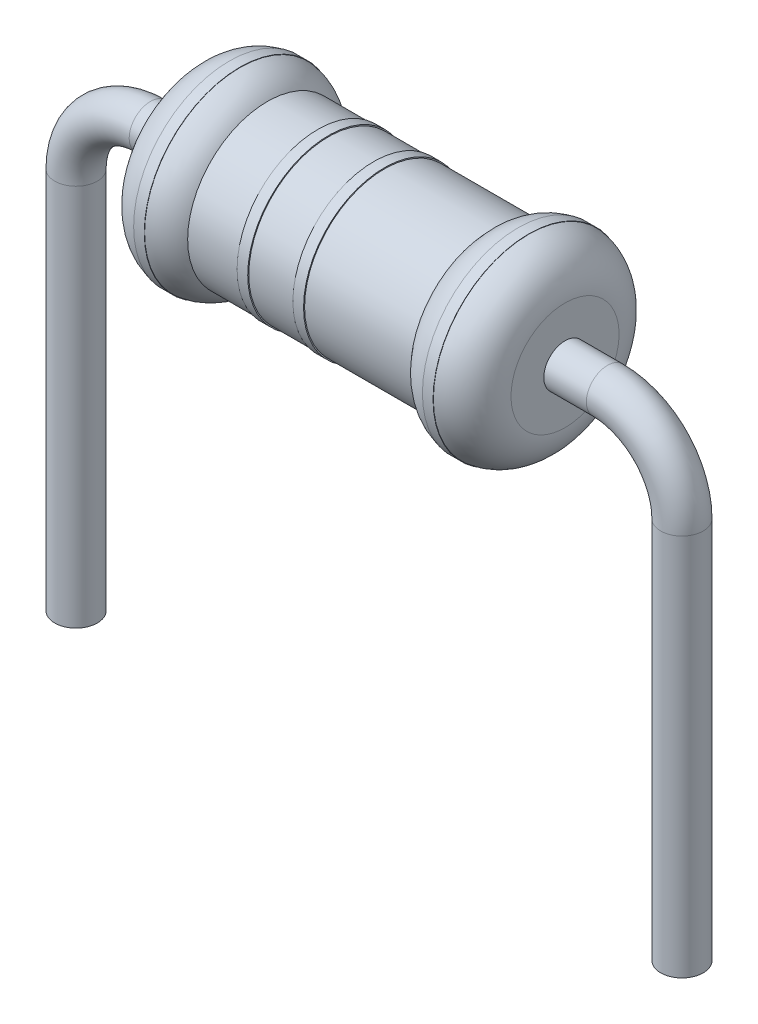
from build123d import *

# Parameters (mm, degrees)
ESQUISSE3_R                  = 0.2
R_P_TITION_CIRCULAIRE1_COUNT = 2


with BuildPart() as part:
    # Esquisse1 → R_volution1 (revolve)
    with BuildSketch(Plane.XY, mode=Mode.PRIVATE) as r_volution1_sk:
        with BuildLine():
            Line((-1.75, 0), (1.75, 0))
            Line((1.75, 0), (1.75, 0.508257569))
            ThreePointArc((1.75, 0.508257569), (1.652408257, 0.766980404), (1.408257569, 0.896796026))
            Line((1.408257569, 0.896796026), (1.408257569, 0.9))
            Line((1.408257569, 0.9), (1.308257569, 0.9))
            Line((1.308257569, 0.9), (1.308257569, 0.896796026))
            ThreePointArc((1.308257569, 0.896796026), (1.164674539, 0.848827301), (1.05, 0.75))
            Line((1.05, 0.75), (0.05, 0.75))
            Line((0.05, 0.75), (0.05, 0.76))
            Line((0.05, 0.76), (-0.05, 0.76))
            Line((-0.05, 0.76), (-0.05, 0.75))
            Line((-0.05, 0.75), (-0.475, 0.75))
            Line((-0.475, 0.75), (-0.475, 0.76))
            Line((-0.475, 0.76), (-0.575, 0.76))
            Line((-0.575, 0.76), (-0.575, 0.75))
            Line((-0.575, 0.75), (-1.05, 0.75))
            ThreePointArc((-1.05, 0.75), (-1.164674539, 0.848827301), (-1.308257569, 0.896796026))
            Line((-1.308257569, 0.896796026), (-1.308257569, 0.9))
            Line((-1.308257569, 0.9), (-1.408257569, 0.9))
            Line((-1.408257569, 0.9), (-1.408257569, 0.896796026))
            ThreePointArc((-1.408257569, 0.896796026), (-1.652408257, 0.766980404), (-1.75, 0.508257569))
            Line((-1.75, 0.508257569), (-1.75, 0))
        make_face()
    revolve(r_volution1_sk.sketch.rotate(Axis((-9.420048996, 0, 0), (1, 0, 0)), 90), axis=Axis((-9.420048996, 0, 0), (1, 0, 0)))

    # Balayage1: sweep along a path in Esquisse2
    with BuildLine(Plane.XY) as balayage1_path:
        Line((-2.85, -4.3), (-2.85, -0.7))
        ThreePointArc((-2.85, -0.7), (-2.644974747, -0.205025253), (-2.15, 0))
        Line((-2.15, 0), (-1.75, 0))
    # Esquisse3 → Balayage1 (sweep)
    with BuildSketch(Plane.ZY.offset(1.75)):
        Circle(ESQUISSE3_R)
    balayage1 = sweep(path=balayage1_path.line)

    # R_p_tition circulaire1: Balayage1 ×2 about axis
    r_p_tition_circulaire1_axis = Axis((0, 0, 0), (0, 1, 0))
    for i in range(1, R_P_TITION_CIRCULAIRE1_COUNT):
        add(balayage1.rotate(r_p_tition_circulaire1_axis, i * 360 / R_P_TITION_CIRCULAIRE1_COUNT))


solid = part.part
